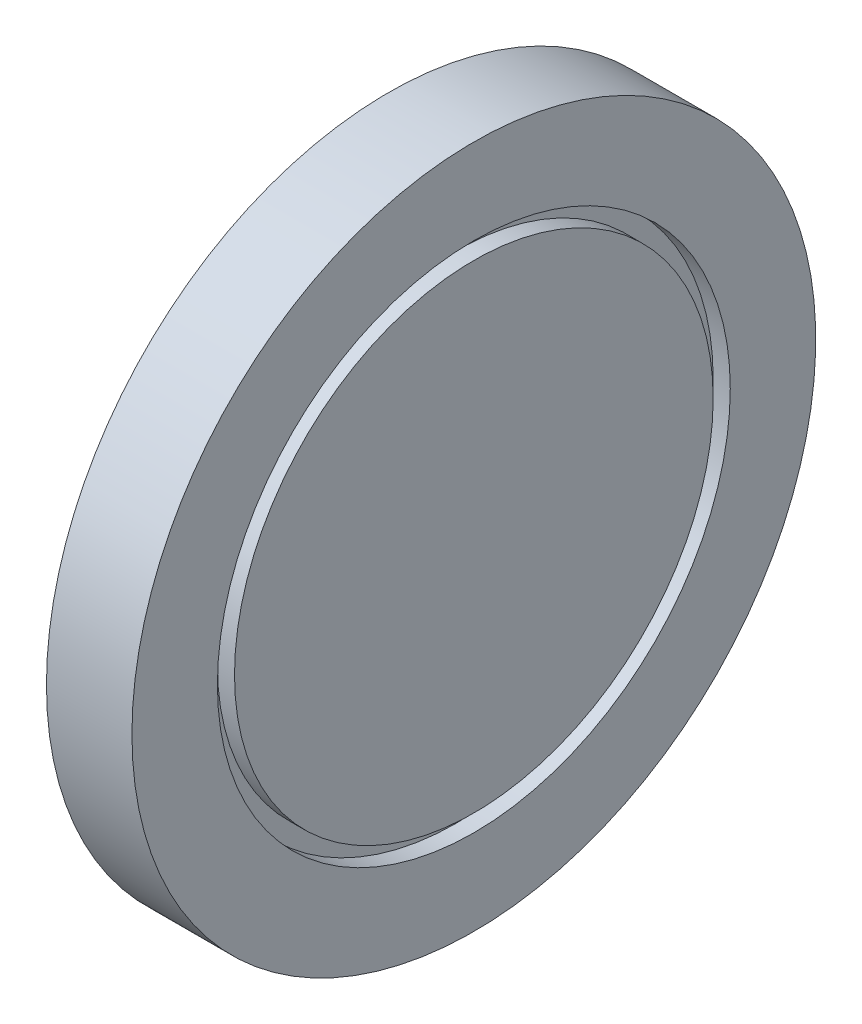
from build123d import *

# Parameters (mm, degrees)
SKETCH1_W               = 25
SKETCH1_H               = 100
SKETCH4_R               = 75
SKETCH4_R_2             = 70
CUT_EXTRUDE2_DEPTH      = 5
SKETCH2_R               = 3.5
BOSS_EXTRUDE1_DEPTH     = 35
CUT_EXTRUDE1_DEPTH      = 146.688022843
CUT_EXTRUDE1_DEPTH_BACK = 146.688022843
SKETCH3_R               = 1.5


with BuildPart() as part:
    # Sketch1 → Revolve1 (revolve)
    with BuildSketch(Plane.XY, mode=Mode.PRIVATE) as revolve1_sk:
        with Locations((12.5, 50)):
            Rectangle(SKETCH1_W, SKETCH1_H)
    revolve(revolve1_sk.sketch.rotate(Axis((-63.852044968, 0, 0), (1, 0, 0)), 90), axis=Axis((-63.852044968, 0, 0), (1, 0, 0)))

    # Sketch4 → Cut-Extrude2 (cut)
    with BuildSketch(Plane(origin=(25, 0, 0), x_dir=(0, 0, -1), z_dir=(1, 0, 0))):
        Circle(SKETCH4_R)
        Circle(SKETCH4_R_2, mode=Mode.SUBTRACT)
    extrude(amount=-CUT_EXTRUDE2_DEPTH, mode=Mode.SUBTRACT)

    # Sketch2 → Boss-Extrude1 (add)
    with BuildSketch(Plane.ZY):
        with Locations(Location((0, 0, 0), (0, 0, 180))):
            Circle(SKETCH2_R)
    extrude(amount=BOSS_EXTRUDE1_DEPTH)

    # Sketch3 → Cut-Extrude1 (cut, two sides: drawn at the far end of the back side and taken through both)
    with BuildSketch(Plane.XY.offset(-CUT_EXTRUDE1_DEPTH_BACK)):
        with Locations((-31.287154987, 0)):
            Circle(SKETCH3_R)
    extrude(amount=CUT_EXTRUDE1_DEPTH + CUT_EXTRUDE1_DEPTH_BACK, mode=Mode.SUBTRACT)


solid = part.part
